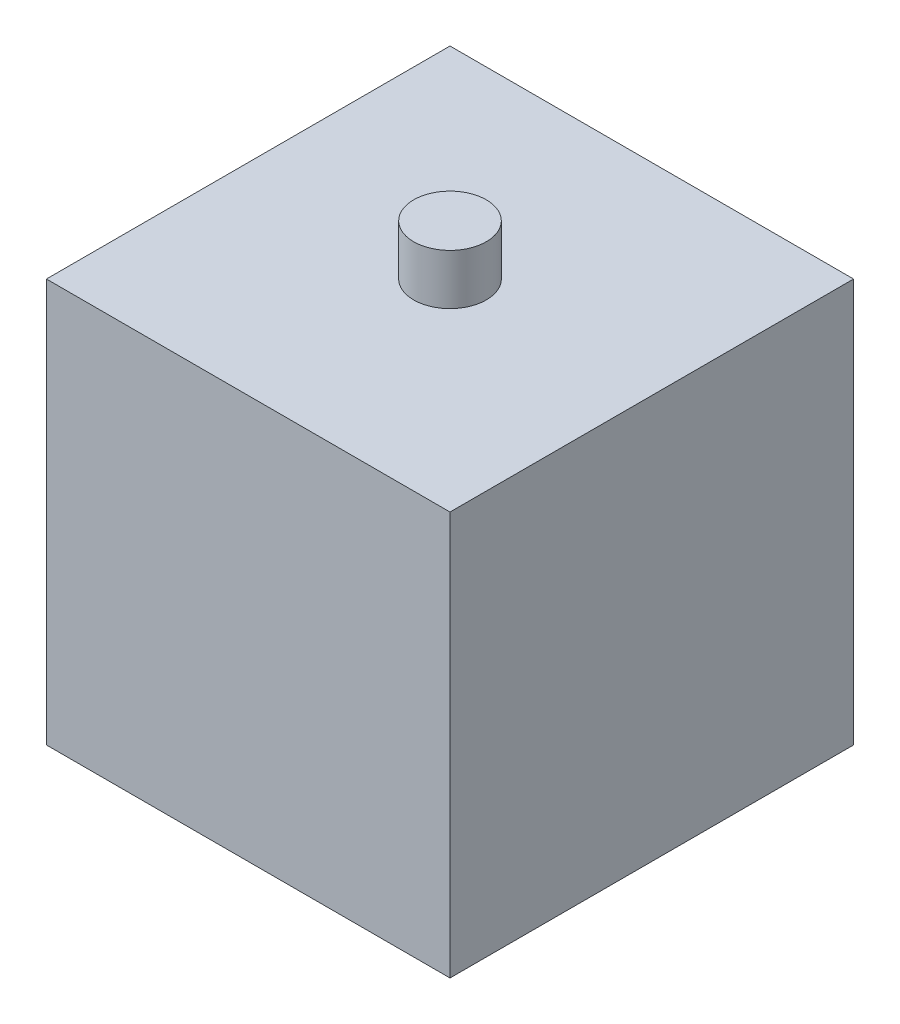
from build123d import *

# Parameters (mm, degrees)
SKETCH1_W      = 25.4
SKETCH1_H      = 25.4
EXTRUDE1_DEPTH = 12.7
SKETCH2_R      = 2.286
EXTRUDE2_DEPTH = 3.175


with BuildPart() as part:
    # Sketch1 → Extrude1 (new, symmetric)
    with BuildSketch(Plane(origin=(0, 0, 0), x_dir=(1, 0, 0), z_dir=(0, 1, 0))):
        Rectangle(SKETCH1_W, SKETCH1_H)
    extrude(amount=EXTRUDE1_DEPTH, both=True)

    # Sketch2 → Extrude2 (add)
    with BuildSketch(Plane(origin=(0, 12.7, 0), x_dir=(1, 0, 0), z_dir=(0, 1, 0))):
        with Locations(Location((0, 0, 0), (0, 0, 270))):
            Circle(SKETCH2_R)
    extrude(amount=EXTRUDE2_DEPTH)


solid = part.part
